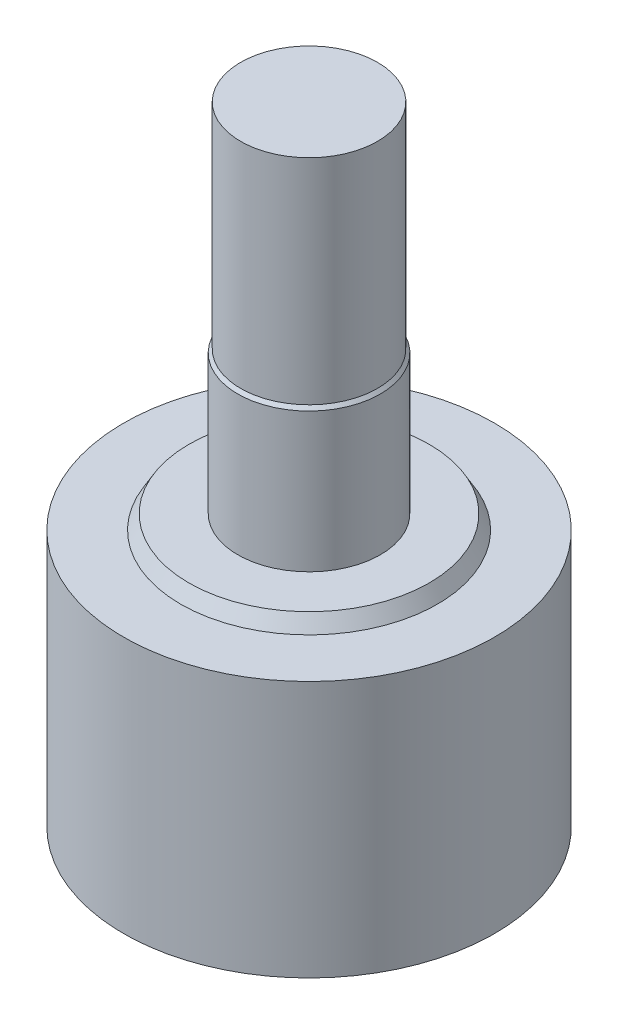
from build123d import *


with BuildPart() as part:
    # Sketch1 → Revolve1 (revolve)
    with BuildSketch(Plane.XY, mode=Mode.PRIVATE) as revolve1_sk:
        Polygon((0, 0), (4.211324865, 0), (4.5, 0.5), (6.5, 0.5), (6.5, 9.5), (4.5, 9.5), (4.211324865, 10), (2.5, 10), (2.5, 14.880824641), (2.4, 15), (2.4, 22.5), (0, 22.5), align=None)
    revolve(revolve1_sk.sketch.rotate(Axis((0, 0, 0), (0, 1, 0)), 90), axis=Axis((0, 0, 0), (0, 1, 0)))


solid = part.part
